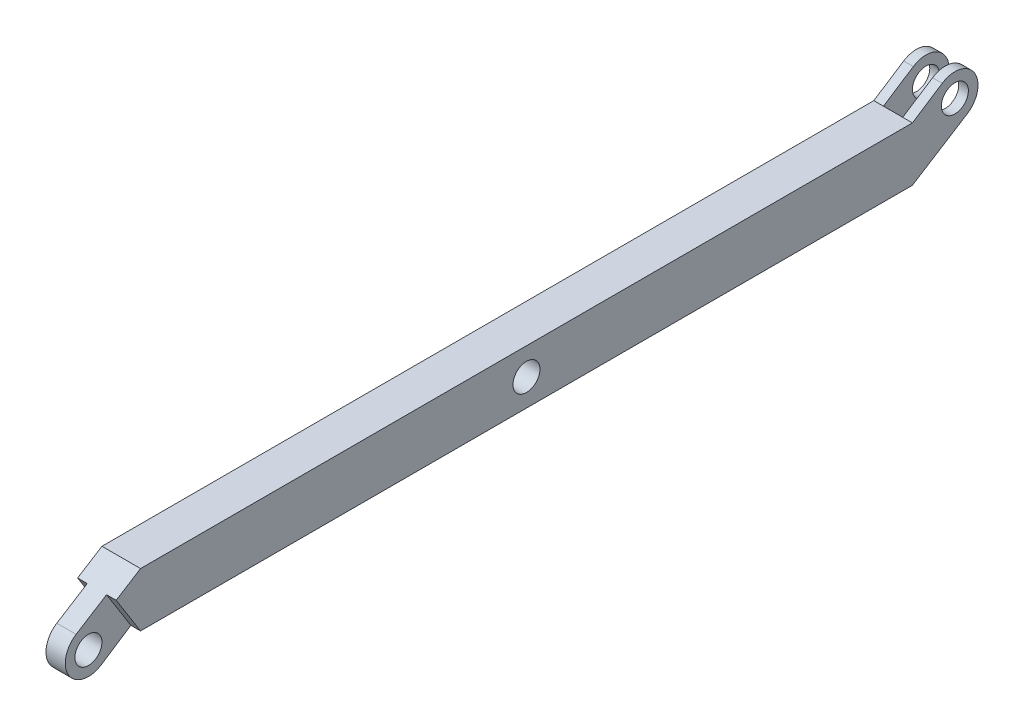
ISO-10303-21;
HEADER;
FILE_DESCRIPTION(('STEP AP214'),'2;1');
FILE_NAME('part.step','',(''),(''),'','','');
FILE_SCHEMA(('AUTOMOTIVE_DESIGN { 1 0 10303 214 1 1 1 1 }'));
ENDSEC;
DATA;
#1=APPLICATION_CONTEXT('core data for automotive mechanical design processes');
#2=APPLICATION_PROTOCOL_DEFINITION('international standard','automotive_design',2000,#1);
#3=PRODUCT_CONTEXT('',#1,'mechanical');
#4=PRODUCT('Part','Part','',(#3));
#5=PRODUCT_RELATED_PRODUCT_CATEGORY('part','',(#4));
#6=PRODUCT_DEFINITION_FORMATION('','',#4);
#7=PRODUCT_DEFINITION_CONTEXT('part definition',#1,'design');
#8=PRODUCT_DEFINITION('design','',#6,#7);
#9=PRODUCT_DEFINITION_SHAPE('','',#8);
#10=(LENGTH_UNIT() NAMED_UNIT(*) SI_UNIT(.MILLI.,.METRE.));
#11=(NAMED_UNIT(*) PLANE_ANGLE_UNIT() SI_UNIT($,.RADIAN.));
#12=(NAMED_UNIT(*) SI_UNIT($,.STERADIAN.) SOLID_ANGLE_UNIT());
#13=UNCERTAINTY_MEASURE_WITH_UNIT(LENGTH_MEASURE(1.E-05),#10,'distance_accuracy_value','');
#14=(GEOMETRIC_REPRESENTATION_CONTEXT(3) GLOBAL_UNCERTAINTY_ASSIGNED_CONTEXT((#13)) GLOBAL_UNIT_ASSIGNED_CONTEXT((#10,
#11,#12)) REPRESENTATION_CONTEXT('',''));
#15=CARTESIAN_POINT('',(0.,0.,0.));
#16=DIRECTION('',(0.,0.,1.));
#17=DIRECTION('',(1.,0.,0.));
#18=AXIS2_PLACEMENT_3D('',#15,#16,#17);
#19=CARTESIAN_POINT('',(25.,-70.,1110.));
#20=DIRECTION('',(1.,0.,0.));
#21=DIRECTION('',(0.,0.,-1.));
#22=AXIS2_PLACEMENT_3D('',#19,#20,#21);
#23=PLANE('',#22);
#24=CARTESIAN_POINT('',(25.,-70.,1110.));
#25=DIRECTION('',(1.,0.,0.));
#26=DIRECTION('',(0.,0.,-1.));
#27=AXIS2_PLACEMENT_3D('',#24,#25,#26);
#28=CIRCLE('',#27,34.9999999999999);
#29=CARTESIAN_POINT('',(25.,-70.,1075.));
#30=VERTEX_POINT('',#29);
#31=EDGE_CURVE('E286',#30,#30,#28,.T.);
#32=ORIENTED_EDGE('',*,*,#31,.F.);
#33=EDGE_LOOP('',(#32));
#34=FACE_BOUND('',#33,.T.);
#35=DIRECTION('',(0.,-0.545454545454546,0.838140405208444));
#36=VECTOR('',#35,1.);
#37=CARTESIAN_POINT('',(25.,-70.,1000.));
#38=LINE('',#37,#36);
#39=CARTESIAN_POINT('',(25.,-70.,1000.));
#40=VERTEX_POINT('',#39);
#41=CARTESIAN_POINT('',(25.,-120.288424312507,1077.27272727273));
#42=VERTEX_POINT('',#41);
#43=EDGE_CURVE('E294',#40,#42,#38,.T.);
#44=ORIENTED_EDGE('',*,*,#43,.F.);
#45=DIRECTION('',(0.,0.84666751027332,0.532122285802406));
#46=VECTOR('',#45,1.);
#47=CARTESIAN_POINT('',(25.,-20.4416284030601,1031.14695397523));
#48=LINE('',#47,#46);
#49=CARTESIAN_POINT('',(25.,30.358422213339,1063.07429112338));
#50=VERTEX_POINT('',#49);
#51=EDGE_CURVE('E328',#40,#50,#48,.T.);
#52=ORIENTED_EDGE('',*,*,#51,.T.);
#53=DIRECTION('',(0.,-0.532122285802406,0.84666751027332));
#54=VECTOR('',#53,1.);
#55=CARTESIAN_POINT('',(25.,69.9999999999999,1000.));
#56=LINE('',#55,#54);
#57=CARTESIAN_POINT('',(25.,-19.1999493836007,1141.92733714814));
#58=VERTEX_POINT('',#57);
#59=EDGE_CURVE('E295',#50,#58,#56,.T.);
#60=ORIENTED_EDGE('',*,*,#59,.T.);
#61=CARTESIAN_POINT('',(25.,-70.,1110.));
#62=DIRECTION('',(1.,0.,0.));
#63=DIRECTION('',(0.,0.,-1.));
#64=AXIS2_PLACEMENT_3D('',#61,#62,#63);
#65=CIRCLE('',#64,60.0000000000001);
#66=EDGE_CURVE('E292',#58,#42,#65,.T.);
#67=ORIENTED_EDGE('',*,*,#66,.T.);
#68=EDGE_LOOP('',(#44,#52,#60,#67));
#69=FACE_BOUND('',#68,.T.);
#70=ADVANCED_FACE('F36',(#34,#69),#23,.T.);
#71=CARTESIAN_POINT('',(-25.,-70.,1110.));
#72=DIRECTION('',(1.,0.,0.));
#73=DIRECTION('',(0.,0.,-1.));
#74=AXIS2_PLACEMENT_3D('',#71,#72,#73);
#75=PLANE('',#74);
#76=CARTESIAN_POINT('',(-25.,-70.,1110.));
#77=DIRECTION('',(1.,0.,0.));
#78=DIRECTION('',(0.,0.,-1.));
#79=AXIS2_PLACEMENT_3D('',#76,#77,#78);
#80=CIRCLE('',#79,34.9999999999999);
#81=CARTESIAN_POINT('',(-25.,-70.,1075.));
#82=VERTEX_POINT('',#81);
#83=EDGE_CURVE('E285',#82,#82,#80,.T.);
#84=ORIENTED_EDGE('',*,*,#83,.T.);
#85=EDGE_LOOP('',(#84));
#86=FACE_BOUND('',#85,.T.);
#87=DIRECTION('',(0.,0.84666751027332,0.532122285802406));
#88=VECTOR('',#87,1.);
#89=CARTESIAN_POINT('',(-25.,-20.4416284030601,1031.14695397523));
#90=LINE('',#89,#88);
#91=CARTESIAN_POINT('',(-25.,-70.,1000.));
#92=VERTEX_POINT('',#91);
#93=CARTESIAN_POINT('',(-25.,30.3584222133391,1063.07429112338));
#94=VERTEX_POINT('',#93);
#95=EDGE_CURVE('E332',#92,#94,#90,.T.);
#96=ORIENTED_EDGE('',*,*,#95,.F.);
#97=DIRECTION('',(0.,-0.545454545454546,0.838140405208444));
#98=VECTOR('',#97,1.);
#99=CARTESIAN_POINT('',(-25.,-70.,1000.));
#100=LINE('',#99,#98);
#101=CARTESIAN_POINT('',(-25.,-120.288424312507,1077.27272727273));
#102=VERTEX_POINT('',#101);
#103=EDGE_CURVE('E299',#92,#102,#100,.T.);
#104=ORIENTED_EDGE('',*,*,#103,.T.);
#105=CARTESIAN_POINT('',(-25.,-70.,1110.));
#106=DIRECTION('',(1.,0.,0.));
#107=DIRECTION('',(0.,0.,-1.));
#108=AXIS2_PLACEMENT_3D('',#105,#106,#107);
#109=CIRCLE('',#108,60.0000000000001);
#110=CARTESIAN_POINT('',(-25.,-19.1999493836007,1141.92733714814));
#111=VERTEX_POINT('',#110);
#112=EDGE_CURVE('E296',#111,#102,#109,.T.);
#113=ORIENTED_EDGE('',*,*,#112,.F.);
#114=DIRECTION('',(0.,-0.532122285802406,0.84666751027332));
#115=VECTOR('',#114,1.);
#116=CARTESIAN_POINT('',(-25.,69.9999999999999,1000.));
#117=LINE('',#116,#115);
#118=EDGE_CURVE('E289',#94,#111,#117,.T.);
#119=ORIENTED_EDGE('',*,*,#118,.F.);
#120=EDGE_LOOP('',(#96,#104,#113,#119));
#121=FACE_BOUND('',#120,.T.);
#122=ADVANCED_FACE('F409',(#86,#121),#75,.F.);
#123=CARTESIAN_POINT('',(-50.,69.9999999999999,-1000.));
#124=DIRECTION('',(0.,-0.838140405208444,-0.545454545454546));
#125=DIRECTION('',(0.,0.545454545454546,-0.838140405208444));
#126=AXIS2_PLACEMENT_3D('',#123,#124,#125);
#127=PLANE('',#126);
#128=DIRECTION('',(0.,0.545454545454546,-0.838140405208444));
#129=VECTOR('',#128,1.);
#130=CARTESIAN_POINT('',(25.,69.9999999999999,-1000.));
#131=LINE('',#130,#129);
#132=CARTESIAN_POINT('',(25.,69.9999999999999,-1000.));
#133=VERTEX_POINT('',#132);
#134=CARTESIAN_POINT('',(25.,120.288424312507,-1077.27272727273));
#135=VERTEX_POINT('',#134);
#136=EDGE_CURVE('E351',#133,#135,#131,.T.);
#137=ORIENTED_EDGE('',*,*,#136,.F.);
#138=DIRECTION('',(-1.,0.,0.));
#139=VECTOR('',#138,1.);
#140=CARTESIAN_POINT('',(50.,69.9999999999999,-1000.));
#141=LINE('',#140,#139);
#142=CARTESIAN_POINT('',(50.,69.9999999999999,-1000.));
#143=VERTEX_POINT('',#142);
#144=EDGE_CURVE('E209',#143,#133,#141,.T.);
#145=ORIENTED_EDGE('',*,*,#144,.F.);
#146=DIRECTION('',(0.,0.545454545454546,-0.838140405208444));
#147=VECTOR('',#146,1.);
#148=CARTESIAN_POINT('',(50.,69.9999999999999,-1000.));
#149=LINE('',#148,#147);
#150=CARTESIAN_POINT('',(50.,120.288424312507,-1077.27272727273));
#151=VERTEX_POINT('',#150);
#152=EDGE_CURVE('E255',#143,#151,#149,.T.);
#153=ORIENTED_EDGE('',*,*,#152,.T.);
#154=DIRECTION('',(1.,0.,0.));
#155=VECTOR('',#154,1.);
#156=CARTESIAN_POINT('',(-50.,120.288424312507,-1077.27272727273));
#157=LINE('',#156,#155);
#158=EDGE_CURVE('E260',#135,#151,#157,.T.);
#159=ORIENTED_EDGE('',*,*,#158,.F.);
#160=EDGE_LOOP('',(#137,#145,#153,#159));
#161=FACE_BOUND('',#160,.T.);
#162=ADVANCED_FACE('F384',(#161),#127,.F.);
#163=CARTESIAN_POINT('',(-50.,70.,-1110.));
#164=DIRECTION('',(1.,0.,0.));
#165=DIRECTION('',(0.,0.,-1.));
#166=AXIS2_PLACEMENT_3D('',#163,#164,#165);
#167=CYLINDRICAL_SURFACE('',#166,60.0000000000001);
#168=CARTESIAN_POINT('',(25.,70.,-1110.));
#169=DIRECTION('',(-1.,0.,0.));
#170=DIRECTION('',(0.,0.,1.));
#171=AXIS2_PLACEMENT_3D('',#168,#169,#170);
#172=CIRCLE('',#171,60.0000000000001);
#173=CARTESIAN_POINT('',(25.,19.1999493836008,-1141.92733714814));
#174=VERTEX_POINT('',#173);
#175=EDGE_CURVE('E360',#135,#174,#172,.T.);
#176=ORIENTED_EDGE('',*,*,#175,.F.);
#177=ORIENTED_EDGE('',*,*,#158,.T.);
#178=CARTESIAN_POINT('',(50.,70.,-1110.));
#179=DIRECTION('',(-1.,0.,0.));
#180=DIRECTION('',(0.,0.,1.));
#181=AXIS2_PLACEMENT_3D('',#178,#179,#180);
#182=CIRCLE('',#181,60.0000000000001);
#183=CARTESIAN_POINT('',(50.,19.1999493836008,-1141.92733714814));
#184=VERTEX_POINT('',#183);
#185=EDGE_CURVE('E239',#151,#184,#182,.T.);
#186=ORIENTED_EDGE('',*,*,#185,.T.);
#187=DIRECTION('',(1.,0.,0.));
#188=VECTOR('',#187,1.);
#189=CARTESIAN_POINT('',(-50.,19.1999493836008,-1141.92733714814));
#190=LINE('',#189,#188);
#191=EDGE_CURVE('E236',#174,#184,#190,.T.);
#192=ORIENTED_EDGE('',*,*,#191,.F.);
#193=EDGE_LOOP('',(#176,#177,#186,#192));
#194=FACE_BOUND('',#193,.T.);
#195=ADVANCED_FACE('F390',(#194),#167,.T.);
#196=CARTESIAN_POINT('',(-50.,70.,-1110.));
#197=DIRECTION('',(1.,0.,0.));
#198=DIRECTION('',(0.,0.,-1.));
#199=AXIS2_PLACEMENT_3D('',#196,#197,#198);
#200=CYLINDRICAL_SURFACE('',#199,34.9999999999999);
#201=CARTESIAN_POINT('',(50.,70.,-1110.));
#202=DIRECTION('',(-1.,0.,0.));
#203=DIRECTION('',(0.,0.,1.));
#204=AXIS2_PLACEMENT_3D('',#201,#202,#203);
#205=CIRCLE('',#204,34.9999999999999);
#206=CARTESIAN_POINT('',(50.,70.,-1145.));
#207=VERTEX_POINT('',#206);
#208=EDGE_CURVE('E365',#207,#207,#205,.T.);
#209=CARTESIAN_POINT('',(25.,70.,-1110.));
#210=DIRECTION('',(-1.,0.,0.));
#211=DIRECTION('',(0.,0.,1.));
#212=AXIS2_PLACEMENT_3D('',#209,#210,#211);
#213=CIRCLE('',#212,34.9999999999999);
#214=CARTESIAN_POINT('',(25.,70.,-1145.));
#215=VERTEX_POINT('',#214);
#216=EDGE_CURVE('E358',#215,#215,#213,.T.);
#217=CARTESIAN_POINT('',(50.,70.,-1145.));
#218=CARTESIAN_POINT('',(49.7395833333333,70.,-1145.));
#219=CARTESIAN_POINT('',(49.4791666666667,70.,-1145.));
#220=CARTESIAN_POINT('',(48.9583333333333,70.,-1145.));
#221=CARTESIAN_POINT('',(48.6979166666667,70.,-1145.));
#222=CARTESIAN_POINT('',(48.1770833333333,70.,-1145.));
#223=CARTESIAN_POINT('',(47.9166666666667,70.,-1145.));
#224=CARTESIAN_POINT('',(47.3958333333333,70.,-1145.));
#225=CARTESIAN_POINT('',(47.1354166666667,70.,-1145.));
#226=CARTESIAN_POINT('',(46.6145833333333,70.,-1145.));
#227=CARTESIAN_POINT('',(46.3541666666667,70.,-1145.));
#228=CARTESIAN_POINT('',(45.8333333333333,70.,-1145.));
#229=CARTESIAN_POINT('',(45.5729166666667,70.,-1145.));
#230=CARTESIAN_POINT('',(45.0520833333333,70.,-1145.));
#231=CARTESIAN_POINT('',(44.7916666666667,70.,-1145.));
#232=CARTESIAN_POINT('',(44.2708333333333,70.,-1145.));
#233=CARTESIAN_POINT('',(44.0104166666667,70.,-1145.));
#234=CARTESIAN_POINT('',(43.4895833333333,70.,-1145.));
#235=CARTESIAN_POINT('',(43.2291666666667,70.,-1145.));
#236=CARTESIAN_POINT('',(42.7083333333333,70.,-1145.));
#237=CARTESIAN_POINT('',(42.4479166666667,70.,-1145.));
#238=CARTESIAN_POINT('',(41.9270833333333,70.,-1145.));
#239=CARTESIAN_POINT('',(41.6666666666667,70.,-1145.));
#240=CARTESIAN_POINT('',(41.1458333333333,70.,-1145.));
#241=CARTESIAN_POINT('',(40.8854166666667,70.,-1145.));
#242=CARTESIAN_POINT('',(40.3645833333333,70.,-1145.));
#243=CARTESIAN_POINT('',(40.1041666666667,70.,-1145.));
#244=CARTESIAN_POINT('',(39.5833333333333,70.,-1145.));
#245=CARTESIAN_POINT('',(39.3229166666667,70.,-1145.));
#246=CARTESIAN_POINT('',(38.8020833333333,70.,-1145.));
#247=CARTESIAN_POINT('',(38.5416666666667,70.,-1145.));
#248=CARTESIAN_POINT('',(38.0208333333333,70.,-1145.));
#249=CARTESIAN_POINT('',(37.7604166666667,70.,-1145.));
#250=CARTESIAN_POINT('',(37.2395833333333,70.,-1145.));
#251=CARTESIAN_POINT('',(36.9791666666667,70.,-1145.));
#252=CARTESIAN_POINT('',(36.4583333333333,70.,-1145.));
#253=CARTESIAN_POINT('',(36.1979166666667,70.,-1145.));
#254=CARTESIAN_POINT('',(35.6770833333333,70.,-1145.));
#255=CARTESIAN_POINT('',(35.4166666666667,70.,-1145.));
#256=CARTESIAN_POINT('',(34.8958333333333,70.,-1145.));
#257=CARTESIAN_POINT('',(34.6354166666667,70.,-1145.));
#258=CARTESIAN_POINT('',(34.1145833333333,70.,-1145.));
#259=CARTESIAN_POINT('',(33.8541666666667,70.,-1145.));
#260=CARTESIAN_POINT('',(33.3333333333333,70.,-1145.));
#261=CARTESIAN_POINT('',(33.0729166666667,70.,-1145.));
#262=CARTESIAN_POINT('',(32.5520833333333,70.,-1145.));
#263=CARTESIAN_POINT('',(32.2916666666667,70.,-1145.));
#264=CARTESIAN_POINT('',(31.7708333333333,70.,-1145.));
#265=CARTESIAN_POINT('',(31.5104166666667,70.,-1145.));
#266=CARTESIAN_POINT('',(30.9895833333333,70.,-1145.));
#267=CARTESIAN_POINT('',(30.7291666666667,70.,-1145.));
#268=CARTESIAN_POINT('',(30.2083333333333,70.,-1145.));
#269=CARTESIAN_POINT('',(29.9479166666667,70.,-1145.));
#270=CARTESIAN_POINT('',(29.4270833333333,70.,-1145.));
#271=CARTESIAN_POINT('',(29.1666666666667,70.,-1145.));
#272=CARTESIAN_POINT('',(28.6458333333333,70.,-1145.));
#273=CARTESIAN_POINT('',(28.3854166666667,70.,-1145.));
#274=CARTESIAN_POINT('',(27.8645833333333,70.,-1145.));
#275=CARTESIAN_POINT('',(27.6041666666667,70.,-1145.));
#276=CARTESIAN_POINT('',(27.0833333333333,70.,-1145.));
#277=CARTESIAN_POINT('',(26.8229166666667,70.,-1145.));
#278=CARTESIAN_POINT('',(26.3020833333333,70.,-1145.));
#279=CARTESIAN_POINT('',(26.0416666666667,70.,-1145.));
#280=CARTESIAN_POINT('',(25.5208333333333,70.,-1145.));
#281=CARTESIAN_POINT('',(25.2604166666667,70.,-1145.));
#282=CARTESIAN_POINT('',(25.,70.,-1145.));
#283=B_SPLINE_CURVE_WITH_KNOTS('',3,(#217,#218,#219,#220,#221,#222,#223,#224,#225,#226,#227,
#228,#229,#230,#231,#232,#233,#234,#235,#236,#237,#238,#239,#240,#241,#242,#243,#244,#245,#246,
#247,#248,#249,#250,#251,#252,#253,#254,#255,#256,#257,#258,#259,#260,#261,#262,#263,#264,#265,
#266,#267,#268,#269,#270,#271,#272,#273,#274,#275,#276,#277,#278,#279,#280,#281,#282),
.UNSPECIFIED.,.F.,.F.,(4,2,2,2,2,2,2,2,2,2,2,2,2,2,2,2,2,2,2,2,2,2,2,2,2,2,2,2,2,2,2,2,4),(0.,
0.781249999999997,1.56249999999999,2.34375000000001,3.125,3.90625,4.6875,5.46874999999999,
6.25000000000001,7.03125,7.8125,8.59375,9.37499999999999,10.15625,10.9375,11.71875,12.5,
13.28125,14.0625,14.84375,15.625,16.40625,17.1875,17.96875,18.75,19.53125,20.3125,21.09375,
21.875,22.65625,23.4375,24.21875,25.),.UNSPECIFIED.);
#284=EDGE_CURVE('BSEAM423',#207,#215,#283,.T.);
#285=ORIENTED_EDGE('',*,*,#208,.F.);
#286=ORIENTED_EDGE('',*,*,#216,.T.);
#287=ORIENTED_EDGE('',*,*,#284,.T.);
#288=ORIENTED_EDGE('',*,*,#284,.F.);
#289=EDGE_LOOP('',(#285,#287,#286,#288));
#290=FACE_BOUND('',#289,.T.);
#291=ADVANCED_FACE('F423',(#290),#200,.F.);
#292=CARTESIAN_POINT('',(-50.,-70.,1000.));
#293=DIRECTION('',(-1.,0.,0.));
#294=DIRECTION('',(0.,0.,1.));
#295=AXIS2_PLACEMENT_3D('',#292,#293,#294);
#296=PLANE('',#295);
#297=DIRECTION('',(0.,0.,-1.));
#298=VECTOR('',#297,1.);
#299=CARTESIAN_POINT('',(-50.,69.9999999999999,1000.));
#300=LINE('',#299,#298);
#301=CARTESIAN_POINT('',(-50.,69.9999999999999,1000.));
#302=VERTEX_POINT('',#301);
#303=CARTESIAN_POINT('',(-50.,69.9999999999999,-1000.));
#304=VERTEX_POINT('',#303);
#305=EDGE_CURVE('E183',#302,#304,#300,.T.);
#306=ORIENTED_EDGE('',*,*,#305,.T.);
#307=DIRECTION('',(0.,0.545454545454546,-0.838140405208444));
#308=VECTOR('',#307,1.);
#309=CARTESIAN_POINT('',(-50.,69.9999999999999,-1000.));
#310=LINE('',#309,#308);
#311=CARTESIAN_POINT('',(-50.,120.288424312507,-1077.27272727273));
#312=VERTEX_POINT('',#311);
#313=EDGE_CURVE('E238',#304,#312,#310,.T.);
#314=ORIENTED_EDGE('',*,*,#313,.T.);
#315=CARTESIAN_POINT('',(-50.,70.,-1110.));
#316=DIRECTION('',(-1.,0.,0.));
#317=DIRECTION('',(0.,0.,1.));
#318=AXIS2_PLACEMENT_3D('',#315,#316,#317);
#319=CIRCLE('',#318,60.0000000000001);
#320=CARTESIAN_POINT('',(-50.,19.1999493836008,-1141.92733714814));
#321=VERTEX_POINT('',#320);
#322=EDGE_CURVE('E246',#312,#321,#319,.T.);
#323=ORIENTED_EDGE('',*,*,#322,.T.);
#324=DIRECTION('',(0.,0.532122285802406,-0.84666751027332));
#325=VECTOR('',#324,1.);
#326=CARTESIAN_POINT('',(-50.,-70.,-1000.));
#327=LINE('',#326,#325);
#328=CARTESIAN_POINT('',(-50.,-70.,-1000.));
#329=VERTEX_POINT('',#328);
#330=EDGE_CURVE('E244',#329,#321,#327,.T.);
#331=ORIENTED_EDGE('',*,*,#330,.F.);
#332=DIRECTION('',(0.,0.,-1.));
#333=VECTOR('',#332,1.);
#334=CARTESIAN_POINT('',(-50.,-70.,1000.));
#335=LINE('',#334,#333);
#336=CARTESIAN_POINT('',(-50.,-70.,1000.));
#337=VERTEX_POINT('',#336);
#338=EDGE_CURVE('E215',#337,#329,#335,.T.);
#339=ORIENTED_EDGE('',*,*,#338,.F.);
#340=DIRECTION('',(0.,0.84666751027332,0.532122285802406));
#341=VECTOR('',#340,1.);
#342=CARTESIAN_POINT('',(-50.,-70.,1000.));
#343=LINE('',#342,#341);
#344=CARTESIAN_POINT('',(-50.,30.358422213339,1063.07429112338));
#345=VERTEX_POINT('',#344);
#346=EDGE_CURVE('E186',#337,#345,#343,.T.);
#347=ORIENTED_EDGE('',*,*,#346,.T.);
#348=DIRECTION('',(0.,0.532122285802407,-0.84666751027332));
#349=VECTOR('',#348,1.);
#350=CARTESIAN_POINT('',(-50.,30.358422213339,1063.07429112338));
#351=LINE('',#350,#349);
#352=EDGE_CURVE('E173',#345,#302,#351,.T.);
#353=ORIENTED_EDGE('',*,*,#352,.T.);
#354=EDGE_LOOP('',(#306,#314,#323,#331,#339,#347,#353));
#355=FACE_BOUND('',#354,.T.);
#356=CARTESIAN_POINT('',(-50.,70.,-1110.));
#357=DIRECTION('',(-1.,0.,0.));
#358=DIRECTION('',(0.,0.,1.));
#359=AXIS2_PLACEMENT_3D('',#356,#357,#358);
#360=CIRCLE('',#359,34.9999999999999);
#361=CARTESIAN_POINT('',(-50.,70.,-1145.));
#362=VERTEX_POINT('',#361);
#363=EDGE_CURVE('E258',#362,#362,#360,.T.);
#364=ORIENTED_EDGE('',*,*,#363,.F.);
#365=EDGE_LOOP('',(#364));
#366=FACE_BOUND('',#365,.T.);
#367=CARTESIAN_POINT('',(-50.,0.,0.));
#368=DIRECTION('',(-1.,0.,0.));
#369=DIRECTION('',(0.,0.,1.));
#370=AXIS2_PLACEMENT_3D('',#367,#368,#369);
#371=CIRCLE('',#370,34.9999999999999);
#372=CARTESIAN_POINT('',(-50.,0.,34.9999999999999));
#373=VERTEX_POINT('',#372);
#374=EDGE_CURVE('E276',#373,#373,#371,.T.);
#375=ORIENTED_EDGE('',*,*,#374,.F.);
#376=EDGE_LOOP('',(#375));
#377=FACE_BOUND('',#376,.T.);
#378=ADVANCED_FACE('F38',(#355,#366,#377),#296,.T.);
#379=CARTESIAN_POINT('',(-50.,-70.,1000.));
#380=DIRECTION('',(0.,1.,0.));
#381=DIRECTION('',(-1.,0.,0.));
#382=AXIS2_PLACEMENT_3D('',#379,#380,#381);
#383=PLANE('',#382);
#384=ORIENTED_EDGE('',*,*,#338,.T.);
#385=DIRECTION('',(1.,0.,0.));
#386=VECTOR('',#385,1.);
#387=CARTESIAN_POINT('',(-50.,-70.,-1000.));
#388=LINE('',#387,#386);
#389=CARTESIAN_POINT('',(50.,-70.,-1000.));
#390=VERTEX_POINT('',#389);
#391=EDGE_CURVE('E179',#329,#390,#388,.T.);
#392=ORIENTED_EDGE('',*,*,#391,.T.);
#393=DIRECTION('',(0.,0.,-1.));
#394=VECTOR('',#393,1.);
#395=CARTESIAN_POINT('',(50.,-70.,1000.));
#396=LINE('',#395,#394);
#397=CARTESIAN_POINT('',(50.,-70.,1000.));
#398=VERTEX_POINT('',#397);
#399=EDGE_CURVE('E198',#398,#390,#396,.T.);
#400=ORIENTED_EDGE('',*,*,#399,.F.);
#401=DIRECTION('',(1.,0.,0.));
#402=VECTOR('',#401,1.);
#403=CARTESIAN_POINT('',(-50.,-70.,1000.));
#404=LINE('',#403,#402);
#405=EDGE_CURVE('E178',#40,#398,#404,.T.);
#406=ORIENTED_EDGE('',*,*,#405,.F.);
#407=DIRECTION('',(-1.,0.,0.));
#408=VECTOR('',#407,1.);
#409=CARTESIAN_POINT('',(25.,-70.,1000.));
#410=LINE('',#409,#408);
#411=EDGE_CURVE('E303',#40,#92,#410,.T.);
#412=ORIENTED_EDGE('',*,*,#411,.T.);
#413=EDGE_CURVE('E196',#337,#92,#404,.T.);
#414=ORIENTED_EDGE('',*,*,#413,.F.);
#415=EDGE_LOOP('',(#384,#392,#400,#406,#412,#414));
#416=FACE_BOUND('',#415,.T.);
#417=ADVANCED_FACE('F241',(#416),#383,.F.);
#418=CARTESIAN_POINT('',(50.,69.9999999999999,1000.));
#419=DIRECTION('',(1.,0.,0.));
#420=DIRECTION('',(0.,0.,-1.));
#421=AXIS2_PLACEMENT_3D('',#418,#419,#420);
#422=PLANE('',#421);
#423=ORIENTED_EDGE('',*,*,#399,.T.);
#424=DIRECTION('',(0.,0.532122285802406,-0.84666751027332));
#425=VECTOR('',#424,1.);
#426=CARTESIAN_POINT('',(50.,-70.,-1000.));
#427=LINE('',#426,#425);
#428=EDGE_CURVE('E223',#390,#184,#427,.T.);
#429=ORIENTED_EDGE('',*,*,#428,.T.);
#430=ORIENTED_EDGE('',*,*,#185,.F.);
#431=ORIENTED_EDGE('',*,*,#152,.F.);
#432=DIRECTION('',(0.,0.,-1.));
#433=VECTOR('',#432,1.);
#434=CARTESIAN_POINT('',(50.,69.9999999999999,1000.));
#435=LINE('',#434,#433);
#436=CARTESIAN_POINT('',(50.,69.9999999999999,1000.));
#437=VERTEX_POINT('',#436);
#438=EDGE_CURVE('E195',#437,#143,#435,.T.);
#439=ORIENTED_EDGE('',*,*,#438,.F.);
#440=DIRECTION('',(0.,0.532122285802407,-0.84666751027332));
#441=VECTOR('',#440,1.);
#442=CARTESIAN_POINT('',(50.,30.358422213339,1063.07429112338));
#443=LINE('',#442,#441);
#444=CARTESIAN_POINT('',(50.,30.358422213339,1063.07429112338));
#445=VERTEX_POINT('',#444);
#446=EDGE_CURVE('E175',#445,#437,#443,.T.);
#447=ORIENTED_EDGE('',*,*,#446,.F.);
#448=DIRECTION('',(0.,0.84666751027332,0.532122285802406));
#449=VECTOR('',#448,1.);
#450=CARTESIAN_POINT('',(50.,-70.,1000.));
#451=LINE('',#450,#449);
#452=EDGE_CURVE('E188',#398,#445,#451,.T.);
#453=ORIENTED_EDGE('',*,*,#452,.F.);
#454=EDGE_LOOP('',(#423,#429,#430,#431,#439,#447,#453));
#455=FACE_BOUND('',#454,.T.);
#456=ORIENTED_EDGE('',*,*,#208,.T.);
#457=EDGE_LOOP('',(#456));
#458=FACE_BOUND('',#457,.T.);
#459=CARTESIAN_POINT('',(50.,0.,0.));
#460=DIRECTION('',(1.,0.,0.));
#461=DIRECTION('',(0.,0.,-1.));
#462=AXIS2_PLACEMENT_3D('',#459,#460,#461);
#463=CIRCLE('',#462,34.9999999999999);
#464=CARTESIAN_POINT('',(50.,0.,-34.9999999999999));
#465=VERTEX_POINT('',#464);
#466=EDGE_CURVE('E273',#465,#465,#463,.T.);
#467=ORIENTED_EDGE('',*,*,#466,.F.);
#468=EDGE_LOOP('',(#467));
#469=FACE_BOUND('',#468,.T.);
#470=ADVANCED_FACE('F220',(#455,#458,#469),#422,.T.);
#471=CARTESIAN_POINT('',(50.,69.9999999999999,1000.));
#472=DIRECTION('',(0.,-1.,0.));
#473=DIRECTION('',(1.,0.,0.));
#474=AXIS2_PLACEMENT_3D('',#471,#472,#473);
#475=PLANE('',#474);
#476=ORIENTED_EDGE('',*,*,#438,.T.);
#477=ORIENTED_EDGE('',*,*,#144,.T.);
#478=DIRECTION('',(1.,0.,0.));
#479=VECTOR('',#478,1.);
#480=CARTESIAN_POINT('',(-25.,69.9999999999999,-1000.));
#481=LINE('',#480,#479);
#482=CARTESIAN_POINT('',(-25.,69.9999999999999,-1000.));
#483=VERTEX_POINT('',#482);
#484=EDGE_CURVE('E349',#483,#133,#481,.T.);
#485=ORIENTED_EDGE('',*,*,#484,.F.);
#486=EDGE_CURVE('E193',#483,#304,#141,.T.);
#487=ORIENTED_EDGE('',*,*,#486,.T.);
#488=ORIENTED_EDGE('',*,*,#305,.F.);
#489=DIRECTION('',(-1.,0.,0.));
#490=VECTOR('',#489,1.);
#491=CARTESIAN_POINT('',(50.,69.9999999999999,1000.));
#492=LINE('',#491,#490);
#493=EDGE_CURVE('E170',#437,#302,#492,.T.);
#494=ORIENTED_EDGE('',*,*,#493,.F.);
#495=EDGE_LOOP('',(#476,#477,#485,#487,#488,#494));
#496=FACE_BOUND('',#495,.T.);
#497=ADVANCED_FACE('F190',(#496),#475,.F.);
#498=CARTESIAN_POINT('',(25.,69.9999999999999,1000.));
#499=DIRECTION('',(0.,-0.84666751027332,-0.532122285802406));
#500=DIRECTION('',(0.,0.532122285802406,-0.84666751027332));
#501=AXIS2_PLACEMENT_3D('',#498,#499,#500);
#502=PLANE('',#501);
#503=ORIENTED_EDGE('',*,*,#493,.T.);
#504=ORIENTED_EDGE('',*,*,#352,.F.);
#505=DIRECTION('',(1.,0.,0.));
#506=VECTOR('',#505,1.);
#507=CARTESIAN_POINT('',(-50.,30.358422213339,1063.07429112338));
#508=LINE('',#507,#506);
#509=EDGE_CURVE('E395',#345,#94,#508,.T.);
#510=ORIENTED_EDGE('',*,*,#509,.T.);
#511=ORIENTED_EDGE('',*,*,#118,.T.);
#512=DIRECTION('',(-1.,0.,0.));
#513=VECTOR('',#512,1.);
#514=CARTESIAN_POINT('',(25.,-19.1999493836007,1141.92733714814));
#515=LINE('',#514,#513);
#516=EDGE_CURVE('E302',#58,#111,#515,.T.);
#517=ORIENTED_EDGE('',*,*,#516,.F.);
#518=ORIENTED_EDGE('',*,*,#59,.F.);
#519=EDGE_CURVE('E397',#50,#445,#508,.T.);
#520=ORIENTED_EDGE('',*,*,#519,.T.);
#521=ORIENTED_EDGE('',*,*,#446,.T.);
#522=EDGE_LOOP('',(#503,#504,#510,#511,#517,#518,#520,#521));
#523=FACE_BOUND('',#522,.T.);
#524=ADVANCED_FACE('F172',(#523),#502,.F.);
#525=CARTESIAN_POINT('',(25.,-70.,1110.));
#526=DIRECTION('',(-1.,0.,0.));
#527=DIRECTION('',(0.,0.,1.));
#528=AXIS2_PLACEMENT_3D('',#525,#526,#527);
#529=CYLINDRICAL_SURFACE('',#528,60.0000000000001);
#530=ORIENTED_EDGE('',*,*,#112,.T.);
#531=DIRECTION('',(-1.,0.,0.));
#532=VECTOR('',#531,1.);
#533=CARTESIAN_POINT('',(25.,-120.288424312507,1077.27272727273));
#534=LINE('',#533,#532);
#535=EDGE_CURVE('E300',#42,#102,#534,.T.);
#536=ORIENTED_EDGE('',*,*,#535,.F.);
#537=ORIENTED_EDGE('',*,*,#66,.F.);
#538=ORIENTED_EDGE('',*,*,#516,.T.);
#539=EDGE_LOOP('',(#530,#536,#537,#538));
#540=FACE_BOUND('',#539,.T.);
#541=ADVANCED_FACE('F452',(#540),#529,.T.);
#542=CARTESIAN_POINT('',(25.,-70.,1000.));
#543=DIRECTION('',(0.,-0.838140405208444,-0.545454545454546));
#544=DIRECTION('',(0.,0.545454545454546,-0.838140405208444));
#545=AXIS2_PLACEMENT_3D('',#542,#543,#544);
#546=PLANE('',#545);
#547=ORIENTED_EDGE('',*,*,#103,.F.);
#548=ORIENTED_EDGE('',*,*,#411,.F.);
#549=ORIENTED_EDGE('',*,*,#43,.T.);
#550=ORIENTED_EDGE('',*,*,#535,.T.);
#551=EDGE_LOOP('',(#547,#548,#549,#550));
#552=FACE_BOUND('',#551,.T.);
#553=ADVANCED_FACE('F449',(#552),#546,.T.);
#554=CARTESIAN_POINT('',(25.,-70.,1110.));
#555=DIRECTION('',(-1.,0.,0.));
#556=DIRECTION('',(0.,0.,1.));
#557=AXIS2_PLACEMENT_3D('',#554,#555,#556);
#558=CYLINDRICAL_SURFACE('',#557,34.9999999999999);
#559=ORIENTED_EDGE('',*,*,#31,.T.);
#560=EDGE_LOOP('',(#559));
#561=FACE_BOUND('',#560,.T.);
#562=ORIENTED_EDGE('',*,*,#83,.F.);
#563=EDGE_LOOP('',(#562));
#564=FACE_BOUND('',#563,.T.);
#565=ADVANCED_FACE('F446',(#561,#564),#558,.F.);
#566=CARTESIAN_POINT('',(-50.000025,0.,0.));
#567=DIRECTION('',(1.,0.,0.));
#568=DIRECTION('',(0.,0.,-1.));
#569=AXIS2_PLACEMENT_3D('',#566,#567,#568);
#570=CYLINDRICAL_SURFACE('',#569,34.9999999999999);
#571=ORIENTED_EDGE('',*,*,#374,.T.);
#572=EDGE_LOOP('',(#571));
#573=FACE_BOUND('',#572,.T.);
#574=ORIENTED_EDGE('',*,*,#466,.T.);
#575=EDGE_LOOP('',(#574));
#576=FACE_BOUND('',#575,.T.);
#577=ADVANCED_FACE('F499',(#573,#576),#570,.F.);
#578=ORIENTED_EDGE('',*,*,#486,.F.);
#579=DIRECTION('',(0.,0.545454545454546,-0.838140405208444));
#580=VECTOR('',#579,1.);
#581=CARTESIAN_POINT('',(-25.,69.9999999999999,-1000.));
#582=LINE('',#581,#580);
#583=CARTESIAN_POINT('',(-25.,120.288424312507,-1077.27272727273));
#584=VERTEX_POINT('',#583);
#585=EDGE_CURVE('E342',#483,#584,#582,.T.);
#586=ORIENTED_EDGE('',*,*,#585,.T.);
#587=EDGE_CURVE('E261',#312,#584,#157,.T.);
#588=ORIENTED_EDGE('',*,*,#587,.F.);
#589=ORIENTED_EDGE('',*,*,#313,.F.);
#590=EDGE_LOOP('',(#578,#586,#588,#589));
#591=FACE_BOUND('',#590,.T.);
#592=ADVANCED_FACE('F371',(#591),#127,.F.);
#593=ORIENTED_EDGE('',*,*,#587,.T.);
#594=CARTESIAN_POINT('',(-25.,70.,-1110.));
#595=DIRECTION('',(-1.,0.,0.));
#596=DIRECTION('',(0.,0.,1.));
#597=AXIS2_PLACEMENT_3D('',#594,#595,#596);
#598=CIRCLE('',#597,60.0000000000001);
#599=CARTESIAN_POINT('',(-25.,19.1999493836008,-1141.92733714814));
#600=VERTEX_POINT('',#599);
#601=EDGE_CURVE('E363',#584,#600,#598,.T.);
#602=ORIENTED_EDGE('',*,*,#601,.T.);
#603=EDGE_CURVE('E250',#321,#600,#190,.T.);
#604=ORIENTED_EDGE('',*,*,#603,.F.);
#605=ORIENTED_EDGE('',*,*,#322,.F.);
#606=EDGE_LOOP('',(#593,#602,#604,#605));
#607=FACE_BOUND('',#606,.T.);
#608=ADVANCED_FACE('F373',(#607),#167,.T.);
#609=CARTESIAN_POINT('',(-50.,-70.,-1000.));
#610=DIRECTION('',(0.,-0.84666751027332,-0.532122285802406));
#611=DIRECTION('',(0.,0.532122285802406,-0.84666751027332));
#612=AXIS2_PLACEMENT_3D('',#609,#610,#611);
#613=PLANE('',#612);
#614=DIRECTION('',(0.,0.532122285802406,-0.84666751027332));
#615=VECTOR('',#614,1.);
#616=CARTESIAN_POINT('',(-25.,-30.3584222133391,-1063.07429112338));
#617=LINE('',#616,#615);
#618=CARTESIAN_POINT('',(-25.,-30.3584222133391,-1063.07429112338));
#619=VERTEX_POINT('',#618);
#620=EDGE_CURVE('E339',#619,#600,#617,.T.);
#621=ORIENTED_EDGE('',*,*,#620,.F.);
#622=DIRECTION('',(1.,0.,0.));
#623=VECTOR('',#622,1.);
#624=CARTESIAN_POINT('',(-25.,-30.3584222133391,-1063.07429112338));
#625=LINE('',#624,#623);
#626=CARTESIAN_POINT('',(25.,-30.3584222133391,-1063.07429112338));
#627=VERTEX_POINT('',#626);
#628=EDGE_CURVE('E355',#619,#627,#625,.T.);
#629=ORIENTED_EDGE('',*,*,#628,.T.);
#630=DIRECTION('',(0.,0.532122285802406,-0.84666751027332));
#631=VECTOR('',#630,1.);
#632=CARTESIAN_POINT('',(25.,-30.3584222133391,-1063.07429112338));
#633=LINE('',#632,#631);
#634=EDGE_CURVE('E338',#627,#174,#633,.T.);
#635=ORIENTED_EDGE('',*,*,#634,.T.);
#636=ORIENTED_EDGE('',*,*,#191,.T.);
#637=ORIENTED_EDGE('',*,*,#428,.F.);
#638=ORIENTED_EDGE('',*,*,#391,.F.);
#639=ORIENTED_EDGE('',*,*,#330,.T.);
#640=ORIENTED_EDGE('',*,*,#603,.T.);
#641=EDGE_LOOP('',(#621,#629,#635,#636,#637,#638,#639,#640));
#642=FACE_BOUND('',#641,.T.);
#643=ADVANCED_FACE('F231',(#642),#613,.T.);
#644=CARTESIAN_POINT('',(-25.,70.,-1110.));
#645=DIRECTION('',(-1.,0.,0.));
#646=DIRECTION('',(0.,0.,1.));
#647=AXIS2_PLACEMENT_3D('',#644,#645,#646);
#648=CIRCLE('',#647,34.9999999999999);
#649=CARTESIAN_POINT('',(-25.,70.,-1145.));
#650=VERTEX_POINT('',#649);
#651=EDGE_CURVE('E362',#650,#650,#648,.T.);
#652=CARTESIAN_POINT('',(-25.,70.,-1145.));
#653=CARTESIAN_POINT('',(-25.2604166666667,70.,-1145.));
#654=CARTESIAN_POINT('',(-25.5208333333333,70.,-1145.));
#655=CARTESIAN_POINT('',(-26.0416666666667,70.,-1145.));
#656=CARTESIAN_POINT('',(-26.3020833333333,70.,-1145.));
#657=CARTESIAN_POINT('',(-26.8229166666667,70.,-1145.));
#658=CARTESIAN_POINT('',(-27.0833333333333,70.,-1145.));
#659=CARTESIAN_POINT('',(-27.6041666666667,70.,-1145.));
#660=CARTESIAN_POINT('',(-27.8645833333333,70.,-1145.));
#661=CARTESIAN_POINT('',(-28.3854166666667,70.,-1145.));
#662=CARTESIAN_POINT('',(-28.6458333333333,70.,-1145.));
#663=CARTESIAN_POINT('',(-29.1666666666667,70.,-1145.));
#664=CARTESIAN_POINT('',(-29.4270833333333,70.,-1145.));
#665=CARTESIAN_POINT('',(-29.9479166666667,70.,-1145.));
#666=CARTESIAN_POINT('',(-30.2083333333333,70.,-1145.));
#667=CARTESIAN_POINT('',(-30.7291666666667,70.,-1145.));
#668=CARTESIAN_POINT('',(-30.9895833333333,70.,-1145.));
#669=CARTESIAN_POINT('',(-31.5104166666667,70.,-1145.));
#670=CARTESIAN_POINT('',(-31.7708333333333,70.,-1145.));
#671=CARTESIAN_POINT('',(-32.2916666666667,70.,-1145.));
#672=CARTESIAN_POINT('',(-32.5520833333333,70.,-1145.));
#673=CARTESIAN_POINT('',(-33.0729166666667,70.,-1145.));
#674=CARTESIAN_POINT('',(-33.3333333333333,70.,-1145.));
#675=CARTESIAN_POINT('',(-33.8541666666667,70.,-1145.));
#676=CARTESIAN_POINT('',(-34.1145833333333,70.,-1145.));
#677=CARTESIAN_POINT('',(-34.6354166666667,70.,-1145.));
#678=CARTESIAN_POINT('',(-34.8958333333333,70.,-1145.));
#679=CARTESIAN_POINT('',(-35.4166666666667,70.,-1145.));
#680=CARTESIAN_POINT('',(-35.6770833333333,70.,-1145.));
#681=CARTESIAN_POINT('',(-36.1979166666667,70.,-1145.));
#682=CARTESIAN_POINT('',(-36.4583333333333,70.,-1145.));
#683=CARTESIAN_POINT('',(-36.9791666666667,70.,-1145.));
#684=CARTESIAN_POINT('',(-37.2395833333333,70.,-1145.));
#685=CARTESIAN_POINT('',(-37.7604166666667,70.,-1145.));
#686=CARTESIAN_POINT('',(-38.0208333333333,70.,-1145.));
#687=CARTESIAN_POINT('',(-38.5416666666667,70.,-1145.));
#688=CARTESIAN_POINT('',(-38.8020833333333,70.,-1145.));
#689=CARTESIAN_POINT('',(-39.3229166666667,70.,-1145.));
#690=CARTESIAN_POINT('',(-39.5833333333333,70.,-1145.));
#691=CARTESIAN_POINT('',(-40.1041666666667,70.,-1145.));
#692=CARTESIAN_POINT('',(-40.3645833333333,70.,-1145.));
#693=CARTESIAN_POINT('',(-40.8854166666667,70.,-1145.));
#694=CARTESIAN_POINT('',(-41.1458333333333,70.,-1145.));
#695=CARTESIAN_POINT('',(-41.6666666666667,70.,-1145.));
#696=CARTESIAN_POINT('',(-41.9270833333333,70.,-1145.));
#697=CARTESIAN_POINT('',(-42.4479166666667,70.,-1145.));
#698=CARTESIAN_POINT('',(-42.7083333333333,70.,-1145.));
#699=CARTESIAN_POINT('',(-43.2291666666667,70.,-1145.));
#700=CARTESIAN_POINT('',(-43.4895833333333,70.,-1145.));
#701=CARTESIAN_POINT('',(-44.0104166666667,70.,-1145.));
#702=CARTESIAN_POINT('',(-44.2708333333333,70.,-1145.));
#703=CARTESIAN_POINT('',(-44.7916666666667,70.,-1145.));
#704=CARTESIAN_POINT('',(-45.0520833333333,70.,-1145.));
#705=CARTESIAN_POINT('',(-45.5729166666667,70.,-1145.));
#706=CARTESIAN_POINT('',(-45.8333333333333,70.,-1145.));
#707=CARTESIAN_POINT('',(-46.3541666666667,70.,-1145.));
#708=CARTESIAN_POINT('',(-46.6145833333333,70.,-1145.));
#709=CARTESIAN_POINT('',(-47.1354166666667,70.,-1145.));
#710=CARTESIAN_POINT('',(-47.3958333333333,70.,-1145.));
#711=CARTESIAN_POINT('',(-47.9166666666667,70.,-1145.));
#712=CARTESIAN_POINT('',(-48.1770833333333,70.,-1145.));
#713=CARTESIAN_POINT('',(-48.6979166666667,70.,-1145.));
#714=CARTESIAN_POINT('',(-48.9583333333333,70.,-1145.));
#715=CARTESIAN_POINT('',(-49.4791666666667,70.,-1145.));
#716=CARTESIAN_POINT('',(-49.7395833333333,70.,-1145.));
#717=CARTESIAN_POINT('',(-50.,70.,-1145.));
#718=B_SPLINE_CURVE_WITH_KNOTS('',3,(#652,#653,#654,#655,#656,#657,#658,#659,#660,#661,#662,
#663,#664,#665,#666,#667,#668,#669,#670,#671,#672,#673,#674,#675,#676,#677,#678,#679,#680,#681,
#682,#683,#684,#685,#686,#687,#688,#689,#690,#691,#692,#693,#694,#695,#696,#697,#698,#699,#700,
#701,#702,#703,#704,#705,#706,#707,#708,#709,#710,#711,#712,#713,#714,#715,#716,#717),
.UNSPECIFIED.,.F.,.F.,(4,2,2,2,2,2,2,2,2,2,2,2,2,2,2,2,2,2,2,2,2,2,2,2,2,2,2,2,2,2,2,2,4),(0.,
0.781250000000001,1.5625,2.34375,3.125,3.90625,4.6875,5.46875,6.25,7.03125,7.8125,
8.59374999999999,9.375,10.15625,10.9375,11.71875,12.5,13.28125,14.0625,14.84375,15.625,16.40625,
17.1875,17.96875,18.75,19.53125,20.3125,21.09375,21.875,22.65625,23.4375,24.21875,25.),.UNSPECIFIED.);
#719=EDGE_CURVE('BSEAM432',#650,#362,#718,.T.);
#720=ORIENTED_EDGE('',*,*,#651,.F.);
#721=ORIENTED_EDGE('',*,*,#363,.T.);
#722=ORIENTED_EDGE('',*,*,#719,.T.);
#723=ORIENTED_EDGE('',*,*,#719,.F.);
#724=EDGE_LOOP('',(#720,#722,#721,#723));
#725=FACE_BOUND('',#724,.T.);
#726=ADVANCED_FACE('F432',(#725),#200,.F.);
#727=CARTESIAN_POINT('',(-25.,-30.3584222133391,-1063.07429112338));
#728=DIRECTION('',(-1.,0.,0.));
#729=DIRECTION('',(0.,0.,1.));
#730=AXIS2_PLACEMENT_3D('',#727,#728,#729);
#731=PLANE('',#730);
#732=ORIENTED_EDGE('',*,*,#651,.T.);
#733=EDGE_LOOP('',(#732));
#734=FACE_BOUND('',#733,.T.);
#735=ORIENTED_EDGE('',*,*,#585,.F.);
#736=DIRECTION('',(0.,-0.84666751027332,-0.532122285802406));
#737=VECTOR('',#736,1.);
#738=CARTESIAN_POINT('',(-25.,69.9999999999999,-1000.));
#739=LINE('',#738,#737);
#740=EDGE_CURVE('E346',#483,#619,#739,.T.);
#741=ORIENTED_EDGE('',*,*,#740,.T.);
#742=ORIENTED_EDGE('',*,*,#620,.T.);
#743=ORIENTED_EDGE('',*,*,#601,.F.);
#744=EDGE_LOOP('',(#735,#741,#742,#743));
#745=FACE_BOUND('',#744,.T.);
#746=ADVANCED_FACE('F375',(#734,#745),#731,.F.);
#747=CARTESIAN_POINT('',(25.,-30.3584222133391,-1063.07429112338));
#748=DIRECTION('',(-1.,0.,0.));
#749=DIRECTION('',(0.,0.,1.));
#750=AXIS2_PLACEMENT_3D('',#747,#748,#749);
#751=PLANE('',#750);
#752=ORIENTED_EDGE('',*,*,#216,.F.);
#753=EDGE_LOOP('',(#752));
#754=FACE_BOUND('',#753,.T.);
#755=ORIENTED_EDGE('',*,*,#175,.T.);
#756=ORIENTED_EDGE('',*,*,#634,.F.);
#757=DIRECTION('',(0.,-0.84666751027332,-0.532122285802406));
#758=VECTOR('',#757,1.);
#759=CARTESIAN_POINT('',(25.,69.9999999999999,-1000.));
#760=LINE('',#759,#758);
#761=EDGE_CURVE('E343',#133,#627,#760,.T.);
#762=ORIENTED_EDGE('',*,*,#761,.F.);
#763=ORIENTED_EDGE('',*,*,#136,.T.);
#764=EDGE_LOOP('',(#755,#756,#762,#763));
#765=FACE_BOUND('',#764,.T.);
#766=ADVANCED_FACE('F388',(#754,#765),#751,.T.);
#767=CARTESIAN_POINT('',(-25.,69.9999999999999,-1000.));
#768=DIRECTION('',(0.,-0.532122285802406,0.84666751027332));
#769=DIRECTION('',(0.,-0.84666751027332,-0.532122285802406));
#770=AXIS2_PLACEMENT_3D('',#767,#768,#769);
#771=PLANE('',#770);
#772=ORIENTED_EDGE('',*,*,#761,.T.);
#773=ORIENTED_EDGE('',*,*,#628,.F.);
#774=ORIENTED_EDGE('',*,*,#740,.F.);
#775=ORIENTED_EDGE('',*,*,#484,.T.);
#776=EDGE_LOOP('',(#772,#773,#774,#775));
#777=FACE_BOUND('',#776,.T.);
#778=ADVANCED_FACE('F378',(#777),#771,.F.);
#779=CARTESIAN_POINT('',(-50.,-70.,1000.));
#780=DIRECTION('',(0.,0.532122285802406,-0.84666751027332));
#781=DIRECTION('',(0.,0.84666751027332,0.532122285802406));
#782=AXIS2_PLACEMENT_3D('',#779,#780,#781);
#783=PLANE('',#782);
#784=ORIENTED_EDGE('',*,*,#413,.T.);
#785=ORIENTED_EDGE('',*,*,#95,.T.);
#786=ORIENTED_EDGE('',*,*,#509,.F.);
#787=ORIENTED_EDGE('',*,*,#346,.F.);
#788=EDGE_LOOP('',(#784,#785,#786,#787));
#789=FACE_BOUND('',#788,.T.);
#790=ADVANCED_FACE('F404',(#789),#783,.F.);
#791=ORIENTED_EDGE('',*,*,#51,.F.);
#792=ORIENTED_EDGE('',*,*,#405,.T.);
#793=ORIENTED_EDGE('',*,*,#452,.T.);
#794=ORIENTED_EDGE('',*,*,#519,.F.);
#795=EDGE_LOOP('',(#791,#792,#793,#794));
#796=FACE_BOUND('',#795,.T.);
#797=ADVANCED_FACE('F602',(#796),#783,.F.);
#798=CLOSED_SHELL('',(#70,#122,#162,#195,#291,#378,#417,#470,#497,#524,#541,#553,#565,#577,#592,
#608,#643,#726,#746,#766,#778,#790,#797));
#799=CARTESIAN_POINT('',(-50.,69.9999999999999,950.));
#800=DIRECTION('',(0.,0.,1.));
#801=DIRECTION('',(1.,0.,0.));
#802=AXIS2_PLACEMENT_3D('',#799,#800,#801);
#803=PLANE('',#802);
#804=DIRECTION('',(0.,1.,0.));
#805=VECTOR('',#804,1.);
#806=CARTESIAN_POINT('',(40.,-60.,950.));
#807=LINE('',#806,#805);
#808=CARTESIAN_POINT('',(40.,-60.,950.));
#809=VERTEX_POINT('',#808);
#810=CARTESIAN_POINT('',(40.,60.,950.));
#811=VERTEX_POINT('',#810);
#812=EDGE_CURVE('E325',#809,#811,#807,.T.);
#813=ORIENTED_EDGE('',*,*,#812,.F.);
#814=DIRECTION('',(-1.,0.,0.));
#815=VECTOR('',#814,1.);
#816=CARTESIAN_POINT('',(40.,-60.,950.));
#817=LINE('',#816,#815);
#818=CARTESIAN_POINT('',(-40.,-60.,950.));
#819=VERTEX_POINT('',#818);
#820=EDGE_CURVE('E59',#809,#819,#817,.T.);
#821=ORIENTED_EDGE('',*,*,#820,.T.);
#822=DIRECTION('',(0.,-1.,0.));
#823=VECTOR('',#822,1.);
#824=CARTESIAN_POINT('',(-40.,60.,950.));
#825=LINE('',#824,#823);
#826=CARTESIAN_POINT('',(-40.,60.,950.));
#827=VERTEX_POINT('',#826);
#828=EDGE_CURVE('E52',#827,#819,#825,.T.);
#829=ORIENTED_EDGE('',*,*,#828,.F.);
#830=DIRECTION('',(1.,0.,0.));
#831=VECTOR('',#830,1.);
#832=CARTESIAN_POINT('',(-40.,60.,950.));
#833=LINE('',#832,#831);
#834=EDGE_CURVE('E12',#827,#811,#833,.T.);
#835=ORIENTED_EDGE('',*,*,#834,.T.);
#836=EDGE_LOOP('',(#813,#821,#829,#835));
#837=FACE_BOUND('',#836,.T.);
#838=ADVANCED_FACE('F327',(#837),#803,.F.);
#839=CARTESIAN_POINT('',(-160.208152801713,0.,0.));
#840=DIRECTION('',(1.,0.,0.));
#841=DIRECTION('',(0.,0.,-1.));
#842=AXIS2_PLACEMENT_3D('',#839,#840,#841);
#843=CYLINDRICAL_SURFACE('',#842,42.5);
#844=CARTESIAN_POINT('',(-40.,0.,0.));
#845=DIRECTION('',(1.,0.,0.));
#846=DIRECTION('',(0.,0.,-1.));
#847=AXIS2_PLACEMENT_3D('',#844,#845,#846);
#848=CIRCLE('',#847,42.5);
#849=CARTESIAN_POINT('',(-40.,0.,-42.5));
#850=VERTEX_POINT('',#849);
#851=EDGE_CURVE('E282',#850,#850,#848,.T.);
#852=ORIENTED_EDGE('',*,*,#851,.T.);
#853=EDGE_LOOP('',(#852));
#854=FACE_BOUND('',#853,.T.);
#855=CARTESIAN_POINT('',(40.,0.,0.));
#856=DIRECTION('',(-1.,0.,0.));
#857=DIRECTION('',(0.,0.,1.));
#858=AXIS2_PLACEMENT_3D('',#855,#856,#857);
#859=CIRCLE('',#858,42.5);
#860=CARTESIAN_POINT('',(40.,0.,42.5));
#861=VERTEX_POINT('',#860);
#862=EDGE_CURVE('E279',#861,#861,#859,.T.);
#863=ORIENTED_EDGE('',*,*,#862,.T.);
#864=EDGE_LOOP('',(#863));
#865=FACE_BOUND('',#864,.T.);
#866=ADVANCED_FACE('F616',(#854,#865),#843,.T.);
#867=CARTESIAN_POINT('',(-50.,69.9999999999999,-960.));
#868=DIRECTION('',(0.,0.,1.));
#869=DIRECTION('',(1.,0.,0.));
#870=AXIS2_PLACEMENT_3D('',#867,#868,#869);
#871=PLANE('',#870);
#872=DIRECTION('',(-1.,0.,0.));
#873=VECTOR('',#872,1.);
#874=CARTESIAN_POINT('',(40.,-60.,-960.));
#875=LINE('',#874,#873);
#876=CARTESIAN_POINT('',(40.,-60.,-960.));
#877=VERTEX_POINT('',#876);
#878=CARTESIAN_POINT('',(-40.,-60.,-960.));
#879=VERTEX_POINT('',#878);
#880=EDGE_CURVE('E270',#877,#879,#875,.T.);
#881=ORIENTED_EDGE('',*,*,#880,.F.);
#882=DIRECTION('',(0.,1.,0.));
#883=VECTOR('',#882,1.);
#884=CARTESIAN_POINT('',(40.,-60.,-960.));
#885=LINE('',#884,#883);
#886=CARTESIAN_POINT('',(40.,60.,-960.));
#887=VERTEX_POINT('',#886);
#888=EDGE_CURVE('E264',#877,#887,#885,.T.);
#889=ORIENTED_EDGE('',*,*,#888,.T.);
#890=DIRECTION('',(1.,0.,0.));
#891=VECTOR('',#890,1.);
#892=CARTESIAN_POINT('',(-40.,60.,-960.));
#893=LINE('',#892,#891);
#894=CARTESIAN_POINT('',(-40.,60.,-960.));
#895=VERTEX_POINT('',#894);
#896=EDGE_CURVE('E45',#895,#887,#893,.T.);
#897=ORIENTED_EDGE('',*,*,#896,.F.);
#898=DIRECTION('',(0.,-1.,0.));
#899=VECTOR('',#898,1.);
#900=CARTESIAN_POINT('',(-40.,60.,-960.));
#901=LINE('',#900,#899);
#902=EDGE_CURVE('E267',#895,#879,#901,.T.);
#903=ORIENTED_EDGE('',*,*,#902,.T.);
#904=EDGE_LOOP('',(#881,#889,#897,#903));
#905=FACE_BOUND('',#904,.T.);
#906=ADVANCED_FACE('F317',(#905),#871,.T.);
#907=CARTESIAN_POINT('',(-40.,60.,1000.));
#908=DIRECTION('',(0.,1.,0.));
#909=DIRECTION('',(0.,0.,1.));
#910=AXIS2_PLACEMENT_3D('',#907,#908,#909);
#911=PLANE('',#910);
#912=ORIENTED_EDGE('',*,*,#834,.F.);
#913=DIRECTION('',(0.,0.,-1.));
#914=VECTOR('',#913,1.);
#915=CARTESIAN_POINT('',(-40.,60.,1000.));
#916=LINE('',#915,#914);
#917=EDGE_CURVE('E306',#827,#895,#916,.T.);
#918=ORIENTED_EDGE('',*,*,#917,.T.);
#919=ORIENTED_EDGE('',*,*,#896,.T.);
#920=DIRECTION('',(0.,0.,-1.));
#921=VECTOR('',#920,1.);
#922=CARTESIAN_POINT('',(40.,60.,1000.));
#923=LINE('',#922,#921);
#924=EDGE_CURVE('E308',#811,#887,#923,.T.);
#925=ORIENTED_EDGE('',*,*,#924,.F.);
#926=EDGE_LOOP('',(#912,#918,#919,#925));
#927=FACE_BOUND('',#926,.T.);
#928=ADVANCED_FACE('F459',(#927),#911,.F.);
#929=CARTESIAN_POINT('',(40.,-60.,1000.));
#930=DIRECTION('',(0.,-1.,0.));
#931=DIRECTION('',(0.,0.,-1.));
#932=AXIS2_PLACEMENT_3D('',#929,#930,#931);
#933=PLANE('',#932);
#934=ORIENTED_EDGE('',*,*,#820,.F.);
#935=DIRECTION('',(0.,0.,-1.));
#936=VECTOR('',#935,1.);
#937=CARTESIAN_POINT('',(40.,-60.,1000.));
#938=LINE('',#937,#936);
#939=EDGE_CURVE('E310',#809,#877,#938,.T.);
#940=ORIENTED_EDGE('',*,*,#939,.T.);
#941=ORIENTED_EDGE('',*,*,#880,.T.);
#942=DIRECTION('',(0.,0.,-1.));
#943=VECTOR('',#942,1.);
#944=CARTESIAN_POINT('',(-40.,-60.,1000.));
#945=LINE('',#944,#943);
#946=EDGE_CURVE('E311',#819,#879,#945,.T.);
#947=ORIENTED_EDGE('',*,*,#946,.F.);
#948=EDGE_LOOP('',(#934,#940,#941,#947));
#949=FACE_BOUND('',#948,.T.);
#950=ADVANCED_FACE('F320',(#949),#933,.F.);
#951=CARTESIAN_POINT('',(40.,-60.,1000.));
#952=DIRECTION('',(-1.,0.,0.));
#953=DIRECTION('',(0.,0.,1.));
#954=AXIS2_PLACEMENT_3D('',#951,#952,#953);
#955=PLANE('',#954);
#956=ORIENTED_EDGE('',*,*,#862,.F.);
#957=EDGE_LOOP('',(#956));
#958=FACE_BOUND('',#957,.T.);
#959=ORIENTED_EDGE('',*,*,#939,.F.);
#960=ORIENTED_EDGE('',*,*,#812,.T.);
#961=ORIENTED_EDGE('',*,*,#924,.T.);
#962=ORIENTED_EDGE('',*,*,#888,.F.);
#963=EDGE_LOOP('',(#959,#960,#961,#962));
#964=FACE_BOUND('',#963,.T.);
#965=ADVANCED_FACE('F324',(#958,#964),#955,.T.);
#966=CARTESIAN_POINT('',(-40.,60.,1000.));
#967=DIRECTION('',(1.,0.,0.));
#968=DIRECTION('',(0.,0.,-1.));
#969=AXIS2_PLACEMENT_3D('',#966,#967,#968);
#970=PLANE('',#969);
#971=ORIENTED_EDGE('',*,*,#851,.F.);
#972=EDGE_LOOP('',(#971));
#973=FACE_BOUND('',#972,.T.);
#974=ORIENTED_EDGE('',*,*,#917,.F.);
#975=ORIENTED_EDGE('',*,*,#828,.T.);
#976=ORIENTED_EDGE('',*,*,#946,.T.);
#977=ORIENTED_EDGE('',*,*,#902,.F.);
#978=EDGE_LOOP('',(#974,#975,#976,#977));
#979=FACE_BOUND('',#978,.T.);
#980=ADVANCED_FACE('F313',(#973,#979),#970,.T.);
#981=CLOSED_SHELL('',(#838,#866,#906,#928,#950,#965,#980));
#982=ORIENTED_CLOSED_SHELL('',*,#981,.T.);
#983=BREP_WITH_VOIDS('B2',#798,(#982));
#984=ADVANCED_BREP_SHAPE_REPRESENTATION('',(#18,#983),#14);
#985=SHAPE_DEFINITION_REPRESENTATION(#9,#984);
ENDSEC;
END-ISO-10303-21;
